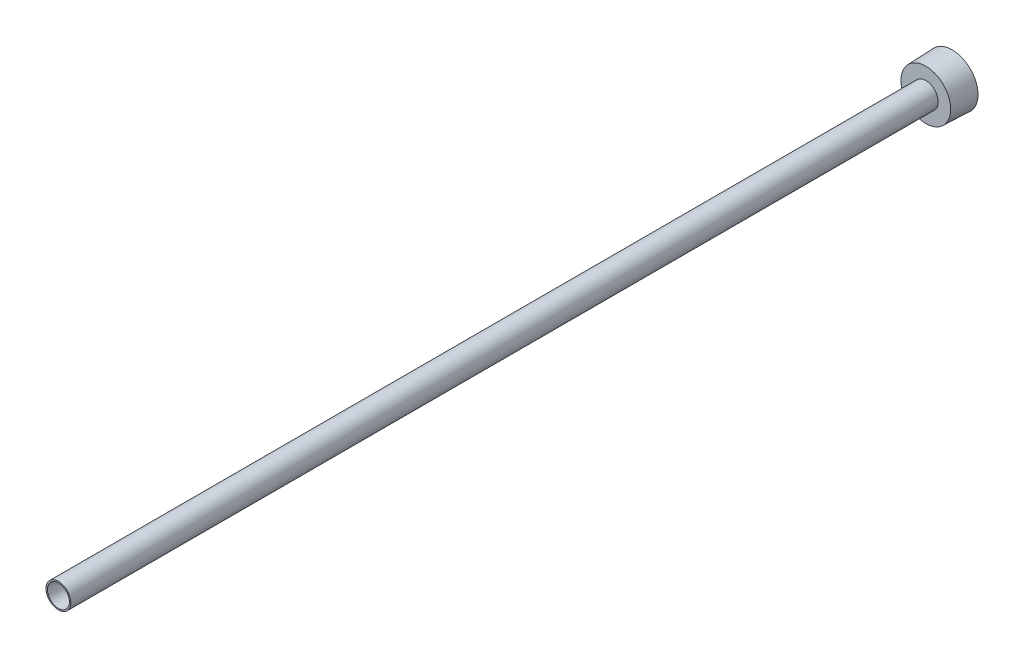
from build123d import *

# Parameters (mm, degrees)
SKETCH2_R          = 5.6388
CUT_EXTRUDE1_DEPTH = 458.582138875
CUT_EXTRUDE2_DEPTH = 9.525


with BuildPart() as part:
    # Sketch1 → Revolve1 (revolve)
    with BuildSketch(Plane(origin=(0, 0, 0), x_dir=(0, 0, -1), z_dir=(1, 0, 0)), mode=Mode.PRIVATE) as revolve1_sk:
        Polygon((-457.2, 0), (0, 0), (0, 13.2207), (-13.4874, 12.728732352), (-13.4874, 6.35), (-457.2, 6.35), align=None)
    revolve(revolve1_sk.sketch.rotate(Axis((0, 0, 278.001114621), (0, 0, -1)), 90), axis=Axis((0, 0, 278.001114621), (0, 0, -1)))

    # Sketch2 → Cut-Extrude1 (cut, through all)
    with BuildSketch(Plane.XY.offset(457.2)):
        Circle(SKETCH2_R)
    extrude(amount=-CUT_EXTRUDE1_DEPTH, mode=Mode.SUBTRACT)

    # Sketch3 → Cut-Extrude2 (cut)
    with BuildSketch(Plane(origin=(0, 0, 0), x_dir=(-1, 0, 0), z_dir=(0, 0, -1))):
        Polygon((-9.525, -5.499261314), (0, -10.998522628), (9.525, -5.499261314), (9.525, 5.499261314), (0, 10.998522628), (-9.525, 5.499261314), align=None)
    extrude(amount=-CUT_EXTRUDE2_DEPTH, mode=Mode.SUBTRACT)


solid = part.part
